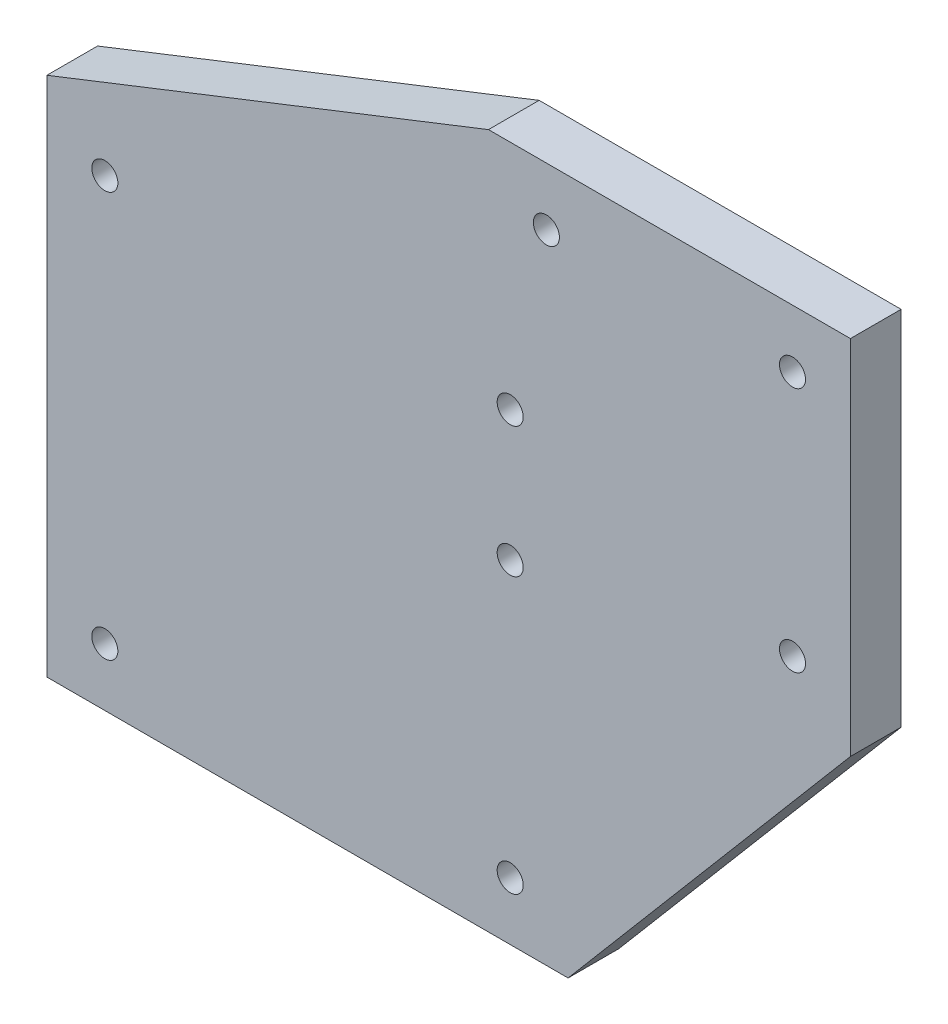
ISO-10303-21;
HEADER;
FILE_DESCRIPTION(('STEP AP214'),'2;1');
FILE_NAME('part.step','',(''),(''),'','','');
FILE_SCHEMA(('AUTOMOTIVE_DESIGN { 1 0 10303 214 1 1 1 1 }'));
ENDSEC;
DATA;
#1=APPLICATION_CONTEXT('core data for automotive mechanical design processes');
#2=APPLICATION_PROTOCOL_DEFINITION('international standard','automotive_design',2000,#1);
#3=PRODUCT_CONTEXT('',#1,'mechanical');
#4=PRODUCT('Part','Part','',(#3));
#5=PRODUCT_RELATED_PRODUCT_CATEGORY('part','',(#4));
#6=PRODUCT_DEFINITION_FORMATION('','',#4);
#7=PRODUCT_DEFINITION_CONTEXT('part definition',#1,'design');
#8=PRODUCT_DEFINITION('design','',#6,#7);
#9=PRODUCT_DEFINITION_SHAPE('','',#8);
#10=(LENGTH_UNIT() NAMED_UNIT(*) SI_UNIT(.MILLI.,.METRE.));
#11=(NAMED_UNIT(*) PLANE_ANGLE_UNIT() SI_UNIT($,.RADIAN.));
#12=(NAMED_UNIT(*) SI_UNIT($,.STERADIAN.) SOLID_ANGLE_UNIT());
#13=UNCERTAINTY_MEASURE_WITH_UNIT(LENGTH_MEASURE(1.E-05),#10,'distance_accuracy_value','');
#14=(GEOMETRIC_REPRESENTATION_CONTEXT(3) GLOBAL_UNCERTAINTY_ASSIGNED_CONTEXT((#13)) GLOBAL_UNIT_ASSIGNED_CONTEXT((#10,
#11,#12)) REPRESENTATION_CONTEXT('',''));
#15=CARTESIAN_POINT('',(0.,0.,0.));
#16=DIRECTION('',(0.,0.,1.));
#17=DIRECTION('',(1.,0.,0.));
#18=AXIS2_PLACEMENT_3D('',#15,#16,#17);
#19=CARTESIAN_POINT('',(89.825238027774,61.110769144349,35.));
#20=DIRECTION('',(0.,0.,1.));
#21=DIRECTION('',(1.,0.,0.));
#22=AXIS2_PLACEMENT_3D('',#19,#20,#21);
#23=PLANE('',#22);
#24=CARTESIAN_POINT('',(335.,260.,35.));
#25=DIRECTION('',(0.,0.,1.));
#26=DIRECTION('',(1.,0.,0.));
#27=AXIS2_PLACEMENT_3D('',#24,#25,#26);
#28=CIRCLE('',#27,9.);
#29=CARTESIAN_POINT('',(344.,260.,35.));
#30=VERTEX_POINT('',#29);
#31=EDGE_CURVE('E19',#30,#30,#28,.T.);
#32=ORIENTED_EDGE('',*,*,#31,.F.);
#33=EDGE_LOOP('',(#32));
#34=FACE_BOUND('',#33,.T.);
#35=CARTESIAN_POINT('',(335.,90.,35.));
#36=DIRECTION('',(0.,0.,1.));
#37=DIRECTION('',(1.,0.,0.));
#38=AXIS2_PLACEMENT_3D('',#35,#36,#37);
#39=CIRCLE('',#38,9.);
#40=CARTESIAN_POINT('',(344.,90.,35.));
#41=VERTEX_POINT('',#40);
#42=EDGE_CURVE('E62',#41,#41,#39,.T.);
#43=ORIENTED_EDGE('',*,*,#42,.F.);
#44=EDGE_LOOP('',(#43));
#45=FACE_BOUND('',#44,.T.);
#46=CARTESIAN_POINT('',(165.,260.,35.));
#47=DIRECTION('',(0.,0.,1.));
#48=DIRECTION('',(1.,0.,0.));
#49=AXIS2_PLACEMENT_3D('',#46,#47,#48);
#50=CIRCLE('',#49,9.);
#51=CARTESIAN_POINT('',(174.,260.,35.));
#52=VERTEX_POINT('',#51);
#53=EDGE_CURVE('E112',#52,#52,#50,.T.);
#54=ORIENTED_EDGE('',*,*,#53,.F.);
#55=EDGE_LOOP('',(#54));
#56=FACE_BOUND('',#55,.T.);
#57=CARTESIAN_POINT('',(140.,50.,35.));
#58=DIRECTION('',(0.,0.,1.));
#59=DIRECTION('',(1.,0.,0.));
#60=AXIS2_PLACEMENT_3D('',#57,#58,#59);
#61=CIRCLE('',#60,9.);
#62=CARTESIAN_POINT('',(149.,50.,35.));
#63=VERTEX_POINT('',#62);
#64=EDGE_CURVE('E105',#63,#63,#61,.T.);
#65=ORIENTED_EDGE('',*,*,#64,.F.);
#66=EDGE_LOOP('',(#65));
#67=FACE_BOUND('',#66,.T.);
#68=CARTESIAN_POINT('',(140.,140.,35.));
#69=DIRECTION('',(0.,0.,1.));
#70=DIRECTION('',(1.,0.,0.));
#71=AXIS2_PLACEMENT_3D('',#68,#69,#70);
#72=CIRCLE('',#71,9.);
#73=CARTESIAN_POINT('',(149.,140.,35.));
#74=VERTEX_POINT('',#73);
#75=EDGE_CURVE('E92',#74,#74,#72,.T.);
#76=ORIENTED_EDGE('',*,*,#75,.F.);
#77=EDGE_LOOP('',(#76));
#78=FACE_BOUND('',#77,.T.);
#79=CARTESIAN_POINT('',(140.,-140.,35.));
#80=DIRECTION('',(0.,0.,1.));
#81=DIRECTION('',(1.,0.,0.));
#82=AXIS2_PLACEMENT_3D('',#79,#80,#81);
#83=CIRCLE('',#82,9.);
#84=CARTESIAN_POINT('',(149.,-140.,35.));
#85=VERTEX_POINT('',#84);
#86=EDGE_CURVE('E237',#85,#85,#83,.T.);
#87=ORIENTED_EDGE('',*,*,#86,.F.);
#88=EDGE_LOOP('',(#87));
#89=FACE_BOUND('',#88,.T.);
#90=CARTESIAN_POINT('',(-140.,140.,35.));
#91=DIRECTION('',(0.,0.,1.));
#92=DIRECTION('',(1.,0.,0.));
#93=AXIS2_PLACEMENT_3D('',#90,#91,#92);
#94=CIRCLE('',#93,9.);
#95=CARTESIAN_POINT('',(-131.,140.,35.));
#96=VERTEX_POINT('',#95);
#97=EDGE_CURVE('E225',#96,#96,#94,.T.);
#98=ORIENTED_EDGE('',*,*,#97,.F.);
#99=EDGE_LOOP('',(#98));
#100=FACE_BOUND('',#99,.T.);
#101=CARTESIAN_POINT('',(-140.,-140.,35.));
#102=DIRECTION('',(0.,0.,1.));
#103=DIRECTION('',(1.,0.,0.));
#104=AXIS2_PLACEMENT_3D('',#101,#102,#103);
#105=CIRCLE('',#104,9.);
#106=CARTESIAN_POINT('',(-131.,-140.,35.));
#107=VERTEX_POINT('',#106);
#108=EDGE_CURVE('E213',#107,#107,#105,.T.);
#109=ORIENTED_EDGE('',*,*,#108,.F.);
#110=EDGE_LOOP('',(#109));
#111=FACE_BOUND('',#110,.T.);
#112=DIRECTION('',(1.,0.,0.));
#113=VECTOR('',#112,1.);
#114=CARTESIAN_POINT('',(-180.,-180.,35.));
#115=LINE('',#114,#113);
#116=CARTESIAN_POINT('',(-180.,-180.,35.));
#117=VERTEX_POINT('',#116);
#118=CARTESIAN_POINT('',(180.,-180.,35.));
#119=VERTEX_POINT('',#118);
#120=EDGE_CURVE('E137',#117,#119,#115,.T.);
#121=ORIENTED_EDGE('',*,*,#120,.T.);
#122=DIRECTION('',(0.646685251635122,0.762756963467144,0.));
#123=VECTOR('',#122,1.);
#124=CARTESIAN_POINT('',(180.,-180.,35.));
#125=LINE('',#124,#123);
#126=CARTESIAN_POINT('',(375.,50.,35.));
#127=VERTEX_POINT('',#126);
#128=EDGE_CURVE('E161',#119,#127,#125,.T.);
#129=ORIENTED_EDGE('',*,*,#128,.T.);
#130=DIRECTION('',(0.,1.,0.));
#131=VECTOR('',#130,1.);
#132=CARTESIAN_POINT('',(375.,50.,35.));
#133=LINE('',#132,#131);
#134=CARTESIAN_POINT('',(375.,300.,35.));
#135=VERTEX_POINT('',#134);
#136=EDGE_CURVE('E187',#127,#135,#133,.T.);
#137=ORIENTED_EDGE('',*,*,#136,.T.);
#138=DIRECTION('',(-1.,0.,0.));
#139=VECTOR('',#138,1.);
#140=CARTESIAN_POINT('',(375.,300.,35.));
#141=LINE('',#140,#139);
#142=CARTESIAN_POINT('',(125.,300.,35.));
#143=VERTEX_POINT('',#142);
#144=EDGE_CURVE('E162',#135,#143,#141,.T.);
#145=ORIENTED_EDGE('',*,*,#144,.T.);
#146=DIRECTION('',(-0.930565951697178,-0.36612430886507,0.));
#147=VECTOR('',#146,1.);
#148=CARTESIAN_POINT('',(125.,300.,35.));
#149=LINE('',#148,#147);
#150=CARTESIAN_POINT('',(-180.,180.,35.));
#151=VERTEX_POINT('',#150);
#152=EDGE_CURVE('E148',#143,#151,#149,.T.);
#153=ORIENTED_EDGE('',*,*,#152,.T.);
#154=DIRECTION('',(0.,-1.,0.));
#155=VECTOR('',#154,1.);
#156=CARTESIAN_POINT('',(-180.,180.,35.));
#157=LINE('',#156,#155);
#158=EDGE_CURVE('E205',#151,#117,#157,.T.);
#159=ORIENTED_EDGE('',*,*,#158,.T.);
#160=EDGE_LOOP('',(#121,#129,#137,#145,#153,#159));
#161=FACE_BOUND('',#160,.T.);
#162=ADVANCED_FACE('F16',(#34,#45,#56,#67,#78,#89,#100,#111,#161),#23,.T.);
#163=CARTESIAN_POINT('',(89.825238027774,61.110769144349,0.));
#164=DIRECTION('',(0.,0.,1.));
#165=DIRECTION('',(1.,0.,0.));
#166=AXIS2_PLACEMENT_3D('',#163,#164,#165);
#167=PLANE('',#166);
#168=CARTESIAN_POINT('',(335.,260.,0.));
#169=DIRECTION('',(0.,0.,1.));
#170=DIRECTION('',(1.,0.,0.));
#171=AXIS2_PLACEMENT_3D('',#168,#169,#170);
#172=CIRCLE('',#171,9.);
#173=CARTESIAN_POINT('',(344.,260.,0.));
#174=VERTEX_POINT('',#173);
#175=EDGE_CURVE('E10',#174,#174,#172,.T.);
#176=ORIENTED_EDGE('',*,*,#175,.T.);
#177=EDGE_LOOP('',(#176));
#178=FACE_BOUND('',#177,.T.);
#179=CARTESIAN_POINT('',(335.,90.,0.));
#180=DIRECTION('',(0.,0.,1.));
#181=DIRECTION('',(1.,0.,0.));
#182=AXIS2_PLACEMENT_3D('',#179,#180,#181);
#183=CIRCLE('',#182,9.);
#184=CARTESIAN_POINT('',(344.,90.,0.));
#185=VERTEX_POINT('',#184);
#186=EDGE_CURVE('E71',#185,#185,#183,.T.);
#187=ORIENTED_EDGE('',*,*,#186,.T.);
#188=EDGE_LOOP('',(#187));
#189=FACE_BOUND('',#188,.T.);
#190=CARTESIAN_POINT('',(165.,260.,0.));
#191=DIRECTION('',(0.,0.,1.));
#192=DIRECTION('',(1.,0.,0.));
#193=AXIS2_PLACEMENT_3D('',#190,#191,#192);
#194=CIRCLE('',#193,9.);
#195=CARTESIAN_POINT('',(174.,260.,0.));
#196=VERTEX_POINT('',#195);
#197=EDGE_CURVE('E118',#196,#196,#194,.T.);
#198=ORIENTED_EDGE('',*,*,#197,.T.);
#199=EDGE_LOOP('',(#198));
#200=FACE_BOUND('',#199,.T.);
#201=CARTESIAN_POINT('',(140.,50.,0.));
#202=DIRECTION('',(0.,0.,1.));
#203=DIRECTION('',(1.,0.,0.));
#204=AXIS2_PLACEMENT_3D('',#201,#202,#203);
#205=CIRCLE('',#204,9.);
#206=CARTESIAN_POINT('',(149.,50.,0.));
#207=VERTEX_POINT('',#206);
#208=EDGE_CURVE('E97',#207,#207,#205,.T.);
#209=ORIENTED_EDGE('',*,*,#208,.T.);
#210=EDGE_LOOP('',(#209));
#211=FACE_BOUND('',#210,.T.);
#212=CARTESIAN_POINT('',(140.,140.,0.));
#213=DIRECTION('',(0.,0.,1.));
#214=DIRECTION('',(1.,0.,0.));
#215=AXIS2_PLACEMENT_3D('',#212,#213,#214);
#216=CIRCLE('',#215,9.);
#217=CARTESIAN_POINT('',(149.,140.,0.));
#218=VERTEX_POINT('',#217);
#219=EDGE_CURVE('E178',#218,#218,#216,.T.);
#220=ORIENTED_EDGE('',*,*,#219,.T.);
#221=EDGE_LOOP('',(#220));
#222=FACE_BOUND('',#221,.T.);
#223=CARTESIAN_POINT('',(140.,-140.,0.));
#224=DIRECTION('',(0.,0.,1.));
#225=DIRECTION('',(1.,0.,0.));
#226=AXIS2_PLACEMENT_3D('',#223,#224,#225);
#227=CIRCLE('',#226,9.);
#228=CARTESIAN_POINT('',(149.,-140.,0.));
#229=VERTEX_POINT('',#228);
#230=EDGE_CURVE('E241',#229,#229,#227,.T.);
#231=ORIENTED_EDGE('',*,*,#230,.T.);
#232=EDGE_LOOP('',(#231));
#233=FACE_BOUND('',#232,.T.);
#234=CARTESIAN_POINT('',(-140.,140.,0.));
#235=DIRECTION('',(0.,0.,1.));
#236=DIRECTION('',(1.,0.,0.));
#237=AXIS2_PLACEMENT_3D('',#234,#235,#236);
#238=CIRCLE('',#237,9.);
#239=CARTESIAN_POINT('',(-131.,140.,0.));
#240=VERTEX_POINT('',#239);
#241=EDGE_CURVE('E229',#240,#240,#238,.T.);
#242=ORIENTED_EDGE('',*,*,#241,.T.);
#243=EDGE_LOOP('',(#242));
#244=FACE_BOUND('',#243,.T.);
#245=CARTESIAN_POINT('',(-140.,-140.,0.));
#246=DIRECTION('',(0.,0.,1.));
#247=DIRECTION('',(1.,0.,0.));
#248=AXIS2_PLACEMENT_3D('',#245,#246,#247);
#249=CIRCLE('',#248,9.);
#250=CARTESIAN_POINT('',(-131.,-140.,0.));
#251=VERTEX_POINT('',#250);
#252=EDGE_CURVE('E217',#251,#251,#249,.T.);
#253=ORIENTED_EDGE('',*,*,#252,.T.);
#254=EDGE_LOOP('',(#253));
#255=FACE_BOUND('',#254,.T.);
#256=DIRECTION('',(0.,-1.,0.));
#257=VECTOR('',#256,1.);
#258=CARTESIAN_POINT('',(-180.,180.,0.));
#259=LINE('',#258,#257);
#260=CARTESIAN_POINT('',(-180.,180.,0.));
#261=VERTEX_POINT('',#260);
#262=CARTESIAN_POINT('',(-180.,-180.,0.));
#263=VERTEX_POINT('',#262);
#264=EDGE_CURVE('E152',#261,#263,#259,.T.);
#265=ORIENTED_EDGE('',*,*,#264,.F.);
#266=DIRECTION('',(-0.930565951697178,-0.36612430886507,0.));
#267=VECTOR('',#266,1.);
#268=CARTESIAN_POINT('',(125.,300.,0.));
#269=LINE('',#268,#267);
#270=CARTESIAN_POINT('',(125.,300.,0.));
#271=VERTEX_POINT('',#270);
#272=EDGE_CURVE('E166',#271,#261,#269,.T.);
#273=ORIENTED_EDGE('',*,*,#272,.F.);
#274=DIRECTION('',(-1.,0.,0.));
#275=VECTOR('',#274,1.);
#276=CARTESIAN_POINT('',(375.,300.,0.));
#277=LINE('',#276,#275);
#278=CARTESIAN_POINT('',(375.,300.,0.));
#279=VERTEX_POINT('',#278);
#280=EDGE_CURVE('E171',#279,#271,#277,.T.);
#281=ORIENTED_EDGE('',*,*,#280,.F.);
#282=DIRECTION('',(0.,1.,0.));
#283=VECTOR('',#282,1.);
#284=CARTESIAN_POINT('',(375.,50.,0.));
#285=LINE('',#284,#283);
#286=CARTESIAN_POINT('',(375.,50.,0.));
#287=VERTEX_POINT('',#286);
#288=EDGE_CURVE('E175',#287,#279,#285,.T.);
#289=ORIENTED_EDGE('',*,*,#288,.F.);
#290=DIRECTION('',(0.646685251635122,0.762756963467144,0.));
#291=VECTOR('',#290,1.);
#292=CARTESIAN_POINT('',(180.,-180.,0.));
#293=LINE('',#292,#291);
#294=CARTESIAN_POINT('',(180.,-180.,0.));
#295=VERTEX_POINT('',#294);
#296=EDGE_CURVE('E147',#295,#287,#293,.T.);
#297=ORIENTED_EDGE('',*,*,#296,.F.);
#298=DIRECTION('',(1.,0.,0.));
#299=VECTOR('',#298,1.);
#300=CARTESIAN_POINT('',(-180.,-180.,0.));
#301=LINE('',#300,#299);
#302=EDGE_CURVE('E130',#263,#295,#301,.T.);
#303=ORIENTED_EDGE('',*,*,#302,.F.);
#304=EDGE_LOOP('',(#265,#273,#281,#289,#297,#303));
#305=FACE_BOUND('',#304,.T.);
#306=ADVANCED_FACE('F98',(#178,#189,#200,#211,#222,#233,#244,#255,#305),#167,.F.);
#307=CARTESIAN_POINT('',(335.,260.,0.));
#308=DIRECTION('',(0.,0.,-1.));
#309=DIRECTION('',(1.,0.,0.));
#310=AXIS2_PLACEMENT_3D('',#307,#308,#309);
#311=CYLINDRICAL_SURFACE('',#310,9.);
#312=DIRECTION('',(0.,0.,1.));
#313=VECTOR('',#312,1.);
#314=CARTESIAN_POINT('',(344.,260.,0.));
#315=LINE('',#314,#313);
#316=EDGE_CURVE('E128',#174,#30,#315,.T.);
#317=ORIENTED_EDGE('',*,*,#316,.T.);
#318=ORIENTED_EDGE('',*,*,#31,.T.);
#319=ORIENTED_EDGE('',*,*,#316,.F.);
#320=ORIENTED_EDGE('',*,*,#175,.F.);
#321=EDGE_LOOP('',(#317,#318,#319,#320));
#322=FACE_BOUND('',#321,.T.);
#323=ADVANCED_FACE('F358',(#322),#311,.F.);
#324=CARTESIAN_POINT('',(335.,90.,0.));
#325=DIRECTION('',(0.,0.,-1.));
#326=DIRECTION('',(1.,0.,0.));
#327=AXIS2_PLACEMENT_3D('',#324,#325,#326);
#328=CYLINDRICAL_SURFACE('',#327,9.);
#329=DIRECTION('',(0.,0.,1.));
#330=VECTOR('',#329,1.);
#331=CARTESIAN_POINT('',(344.,90.,0.));
#332=LINE('',#331,#330);
#333=EDGE_CURVE('E119',#185,#41,#332,.T.);
#334=ORIENTED_EDGE('',*,*,#333,.T.);
#335=ORIENTED_EDGE('',*,*,#42,.T.);
#336=ORIENTED_EDGE('',*,*,#333,.F.);
#337=ORIENTED_EDGE('',*,*,#186,.F.);
#338=EDGE_LOOP('',(#334,#335,#336,#337));
#339=FACE_BOUND('',#338,.T.);
#340=ADVANCED_FACE('F362',(#339),#328,.F.);
#341=CARTESIAN_POINT('',(165.,260.,0.));
#342=DIRECTION('',(0.,0.,-1.));
#343=DIRECTION('',(1.,0.,0.));
#344=AXIS2_PLACEMENT_3D('',#341,#342,#343);
#345=CYLINDRICAL_SURFACE('',#344,9.);
#346=DIRECTION('',(0.,0.,1.));
#347=VECTOR('',#346,1.);
#348=CARTESIAN_POINT('',(174.,260.,0.));
#349=LINE('',#348,#347);
#350=EDGE_CURVE('E104',#196,#52,#349,.T.);
#351=ORIENTED_EDGE('',*,*,#350,.T.);
#352=ORIENTED_EDGE('',*,*,#53,.T.);
#353=ORIENTED_EDGE('',*,*,#350,.F.);
#354=ORIENTED_EDGE('',*,*,#197,.F.);
#355=EDGE_LOOP('',(#351,#352,#353,#354));
#356=FACE_BOUND('',#355,.T.);
#357=ADVANCED_FACE('F363',(#356),#345,.F.);
#358=CARTESIAN_POINT('',(140.,50.,0.));
#359=DIRECTION('',(0.,0.,-1.));
#360=DIRECTION('',(1.,0.,0.));
#361=AXIS2_PLACEMENT_3D('',#358,#359,#360);
#362=CYLINDRICAL_SURFACE('',#361,9.);
#363=DIRECTION('',(0.,0.,1.));
#364=VECTOR('',#363,1.);
#365=CARTESIAN_POINT('',(149.,50.,0.));
#366=LINE('',#365,#364);
#367=EDGE_CURVE('E114',#207,#63,#366,.T.);
#368=ORIENTED_EDGE('',*,*,#367,.T.);
#369=ORIENTED_EDGE('',*,*,#64,.T.);
#370=ORIENTED_EDGE('',*,*,#367,.F.);
#371=ORIENTED_EDGE('',*,*,#208,.F.);
#372=EDGE_LOOP('',(#368,#369,#370,#371));
#373=FACE_BOUND('',#372,.T.);
#374=ADVANCED_FACE('F250',(#373),#362,.F.);
#375=CARTESIAN_POINT('',(140.,140.,0.));
#376=DIRECTION('',(0.,0.,-1.));
#377=DIRECTION('',(1.,0.,0.));
#378=AXIS2_PLACEMENT_3D('',#375,#376,#377);
#379=CYLINDRICAL_SURFACE('',#378,9.);
#380=DIRECTION('',(0.,0.,1.));
#381=VECTOR('',#380,1.);
#382=CARTESIAN_POINT('',(149.,140.,0.));
#383=LINE('',#382,#381);
#384=EDGE_CURVE('E179',#218,#74,#383,.T.);
#385=ORIENTED_EDGE('',*,*,#384,.T.);
#386=ORIENTED_EDGE('',*,*,#75,.T.);
#387=ORIENTED_EDGE('',*,*,#384,.F.);
#388=ORIENTED_EDGE('',*,*,#219,.F.);
#389=EDGE_LOOP('',(#385,#386,#387,#388));
#390=FACE_BOUND('',#389,.T.);
#391=ADVANCED_FACE('F352',(#390),#379,.F.);
#392=CARTESIAN_POINT('',(140.,-140.,0.));
#393=DIRECTION('',(0.,0.,-1.));
#394=DIRECTION('',(1.,0.,0.));
#395=AXIS2_PLACEMENT_3D('',#392,#393,#394);
#396=CYLINDRICAL_SURFACE('',#395,9.);
#397=DIRECTION('',(0.,0.,1.));
#398=VECTOR('',#397,1.);
#399=CARTESIAN_POINT('',(149.,-140.,0.));
#400=LINE('',#399,#398);
#401=EDGE_CURVE('E233',#229,#85,#400,.T.);
#402=ORIENTED_EDGE('',*,*,#401,.T.);
#403=ORIENTED_EDGE('',*,*,#86,.T.);
#404=ORIENTED_EDGE('',*,*,#401,.F.);
#405=ORIENTED_EDGE('',*,*,#230,.F.);
#406=EDGE_LOOP('',(#402,#403,#404,#405));
#407=FACE_BOUND('',#406,.T.);
#408=ADVANCED_FACE('F354',(#407),#396,.F.);
#409=CARTESIAN_POINT('',(-140.,140.,0.));
#410=DIRECTION('',(0.,0.,-1.));
#411=DIRECTION('',(1.,0.,0.));
#412=AXIS2_PLACEMENT_3D('',#409,#410,#411);
#413=CYLINDRICAL_SURFACE('',#412,9.);
#414=DIRECTION('',(0.,0.,1.));
#415=VECTOR('',#414,1.);
#416=CARTESIAN_POINT('',(-131.,140.,0.));
#417=LINE('',#416,#415);
#418=EDGE_CURVE('E220',#240,#96,#417,.T.);
#419=ORIENTED_EDGE('',*,*,#418,.T.);
#420=ORIENTED_EDGE('',*,*,#97,.T.);
#421=ORIENTED_EDGE('',*,*,#418,.F.);
#422=ORIENTED_EDGE('',*,*,#241,.F.);
#423=EDGE_LOOP('',(#419,#420,#421,#422));
#424=FACE_BOUND('',#423,.T.);
#425=ADVANCED_FACE('F347',(#424),#413,.F.);
#426=CARTESIAN_POINT('',(-140.,-140.,0.));
#427=DIRECTION('',(0.,0.,-1.));
#428=DIRECTION('',(1.,0.,0.));
#429=AXIS2_PLACEMENT_3D('',#426,#427,#428);
#430=CYLINDRICAL_SURFACE('',#429,9.);
#431=DIRECTION('',(0.,0.,1.));
#432=VECTOR('',#431,1.);
#433=CARTESIAN_POINT('',(-131.,-140.,0.));
#434=LINE('',#433,#432);
#435=EDGE_CURVE('E209',#251,#107,#434,.T.);
#436=ORIENTED_EDGE('',*,*,#435,.T.);
#437=ORIENTED_EDGE('',*,*,#108,.T.);
#438=ORIENTED_EDGE('',*,*,#435,.F.);
#439=ORIENTED_EDGE('',*,*,#252,.F.);
#440=EDGE_LOOP('',(#436,#437,#438,#439));
#441=FACE_BOUND('',#440,.T.);
#442=ADVANCED_FACE('F339',(#441),#430,.F.);
#443=CARTESIAN_POINT('',(-180.,180.,0.));
#444=DIRECTION('',(1.,0.,0.));
#445=DIRECTION('',(0.,1.,0.));
#446=AXIS2_PLACEMENT_3D('',#443,#444,#445);
#447=PLANE('',#446);
#448=ORIENTED_EDGE('',*,*,#264,.T.);
#449=DIRECTION('',(0.,0.,1.));
#450=VECTOR('',#449,1.);
#451=CARTESIAN_POINT('',(-180.,-180.,0.));
#452=LINE('',#451,#450);
#453=EDGE_CURVE('E143',#263,#117,#452,.T.);
#454=ORIENTED_EDGE('',*,*,#453,.T.);
#455=ORIENTED_EDGE('',*,*,#158,.F.);
#456=DIRECTION('',(0.,0.,1.));
#457=VECTOR('',#456,1.);
#458=CARTESIAN_POINT('',(-180.,180.,0.));
#459=LINE('',#458,#457);
#460=EDGE_CURVE('E153',#261,#151,#459,.T.);
#461=ORIENTED_EDGE('',*,*,#460,.F.);
#462=EDGE_LOOP('',(#448,#454,#455,#461));
#463=FACE_BOUND('',#462,.T.);
#464=ADVANCED_FACE('F337',(#463),#447,.F.);
#465=CARTESIAN_POINT('',(125.,300.,0.));
#466=DIRECTION('',(0.36612430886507,-0.930565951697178,0.));
#467=DIRECTION('',(0.,0.,-1.));
#468=AXIS2_PLACEMENT_3D('',#465,#466,#467);
#469=PLANE('',#468);
#470=ORIENTED_EDGE('',*,*,#272,.T.);
#471=ORIENTED_EDGE('',*,*,#460,.T.);
#472=ORIENTED_EDGE('',*,*,#152,.F.);
#473=DIRECTION('',(0.,0.,1.));
#474=VECTOR('',#473,1.);
#475=CARTESIAN_POINT('',(125.,300.,0.));
#476=LINE('',#475,#474);
#477=EDGE_CURVE('E167',#271,#143,#476,.T.);
#478=ORIENTED_EDGE('',*,*,#477,.F.);
#479=EDGE_LOOP('',(#470,#471,#472,#478));
#480=FACE_BOUND('',#479,.T.);
#481=ADVANCED_FACE('F330',(#480),#469,.F.);
#482=CARTESIAN_POINT('',(375.,300.,0.));
#483=DIRECTION('',(0.,-1.,0.));
#484=DIRECTION('',(0.,0.,-1.));
#485=AXIS2_PLACEMENT_3D('',#482,#483,#484);
#486=PLANE('',#485);
#487=ORIENTED_EDGE('',*,*,#280,.T.);
#488=ORIENTED_EDGE('',*,*,#477,.T.);
#489=ORIENTED_EDGE('',*,*,#144,.F.);
#490=DIRECTION('',(0.,0.,1.));
#491=VECTOR('',#490,1.);
#492=CARTESIAN_POINT('',(375.,300.,0.));
#493=LINE('',#492,#491);
#494=EDGE_CURVE('E183',#279,#135,#493,.T.);
#495=ORIENTED_EDGE('',*,*,#494,.F.);
#496=EDGE_LOOP('',(#487,#488,#489,#495));
#497=FACE_BOUND('',#496,.T.);
#498=ADVANCED_FACE('F334',(#497),#486,.F.);
#499=CARTESIAN_POINT('',(375.,50.,0.));
#500=DIRECTION('',(-1.,0.,0.));
#501=DIRECTION('',(0.,0.,1.));
#502=AXIS2_PLACEMENT_3D('',#499,#500,#501);
#503=PLANE('',#502);
#504=ORIENTED_EDGE('',*,*,#288,.T.);
#505=ORIENTED_EDGE('',*,*,#494,.T.);
#506=ORIENTED_EDGE('',*,*,#136,.F.);
#507=DIRECTION('',(0.,0.,1.));
#508=VECTOR('',#507,1.);
#509=CARTESIAN_POINT('',(375.,50.,0.));
#510=LINE('',#509,#508);
#511=EDGE_CURVE('E157',#287,#127,#510,.T.);
#512=ORIENTED_EDGE('',*,*,#511,.F.);
#513=EDGE_LOOP('',(#504,#505,#506,#512));
#514=FACE_BOUND('',#513,.T.);
#515=ADVANCED_FACE('F434',(#514),#503,.F.);
#516=CARTESIAN_POINT('',(180.,-180.,0.));
#517=DIRECTION('',(-0.762756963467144,0.646685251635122,0.));
#518=DIRECTION('',(0.,0.,1.));
#519=AXIS2_PLACEMENT_3D('',#516,#517,#518);
#520=PLANE('',#519);
#521=ORIENTED_EDGE('',*,*,#296,.T.);
#522=ORIENTED_EDGE('',*,*,#511,.T.);
#523=ORIENTED_EDGE('',*,*,#128,.F.);
#524=DIRECTION('',(0.,0.,1.));
#525=VECTOR('',#524,1.);
#526=CARTESIAN_POINT('',(180.,-180.,0.));
#527=LINE('',#526,#525);
#528=EDGE_CURVE('E133',#295,#119,#527,.T.);
#529=ORIENTED_EDGE('',*,*,#528,.F.);
#530=EDGE_LOOP('',(#521,#522,#523,#529));
#531=FACE_BOUND('',#530,.T.);
#532=ADVANCED_FACE('F278',(#531),#520,.F.);
#533=CARTESIAN_POINT('',(-180.,-180.,0.));
#534=DIRECTION('',(0.,1.,0.));
#535=DIRECTION('',(1.,0.,0.));
#536=AXIS2_PLACEMENT_3D('',#533,#534,#535);
#537=PLANE('',#536);
#538=ORIENTED_EDGE('',*,*,#302,.T.);
#539=ORIENTED_EDGE('',*,*,#528,.T.);
#540=ORIENTED_EDGE('',*,*,#120,.F.);
#541=ORIENTED_EDGE('',*,*,#453,.F.);
#542=EDGE_LOOP('',(#538,#539,#540,#541));
#543=FACE_BOUND('',#542,.T.);
#544=ADVANCED_FACE('F275',(#543),#537,.F.);
#545=CLOSED_SHELL('',(#162,#306,#323,#340,#357,#374,#391,#408,#425,#442,#464,#481,#498,#515,
#532,#544));
#546=MANIFOLD_SOLID_BREP('B1',#545);
#547=ADVANCED_BREP_SHAPE_REPRESENTATION('',(#18,#546),#14);
#548=SHAPE_DEFINITION_REPRESENTATION(#9,#547);
ENDSEC;
END-ISO-10303-21;
